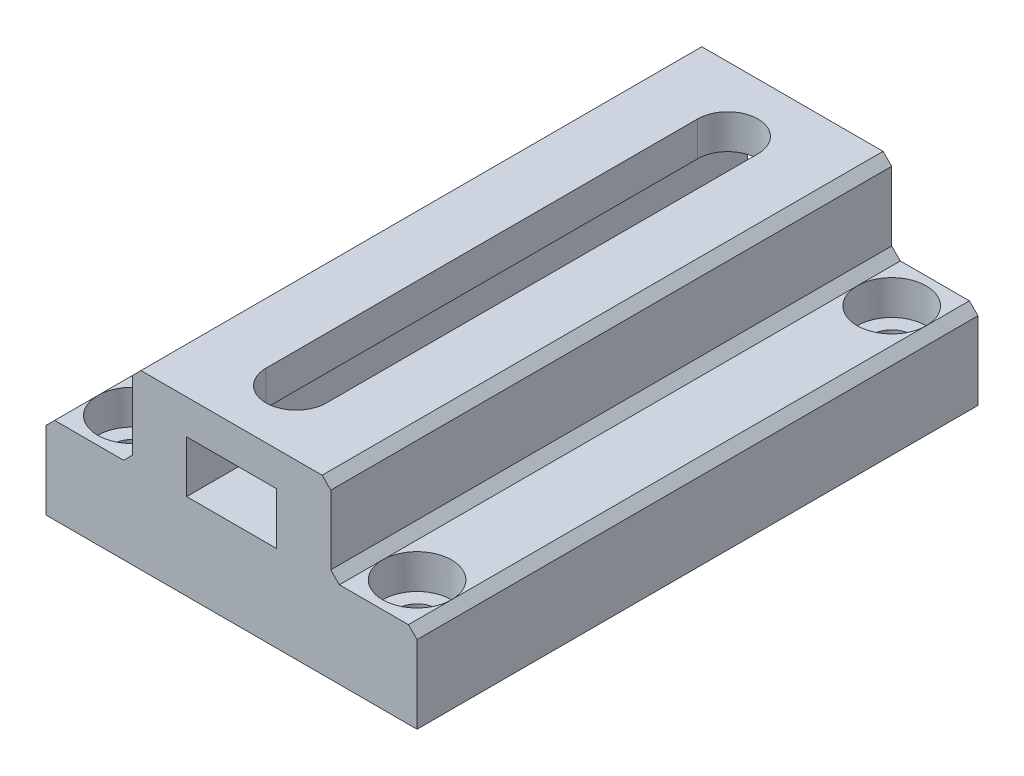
ISO-10303-21;
HEADER;
FILE_DESCRIPTION(('STEP AP214'),'2;1');
FILE_NAME('part.step','',(''),(''),'','','');
FILE_SCHEMA(('AUTOMOTIVE_DESIGN { 1 0 10303 214 1 1 1 1 }'));
ENDSEC;
DATA;
#1=APPLICATION_CONTEXT('core data for automotive mechanical design processes');
#2=APPLICATION_PROTOCOL_DEFINITION('international standard','automotive_design',2000,#1);
#3=PRODUCT_CONTEXT('',#1,'mechanical');
#4=PRODUCT('Part','Part','',(#3));
#5=PRODUCT_RELATED_PRODUCT_CATEGORY('part','',(#4));
#6=PRODUCT_DEFINITION_FORMATION('','',#4);
#7=PRODUCT_DEFINITION_CONTEXT('part definition',#1,'design');
#8=PRODUCT_DEFINITION('design','',#6,#7);
#9=PRODUCT_DEFINITION_SHAPE('','',#8);
#10=(LENGTH_UNIT() NAMED_UNIT(*) SI_UNIT(.MILLI.,.METRE.));
#11=(NAMED_UNIT(*) PLANE_ANGLE_UNIT() SI_UNIT($,.RADIAN.));
#12=(NAMED_UNIT(*) SI_UNIT($,.STERADIAN.) SOLID_ANGLE_UNIT());
#13=UNCERTAINTY_MEASURE_WITH_UNIT(LENGTH_MEASURE(1.E-05),#10,'distance_accuracy_value','');
#14=(GEOMETRIC_REPRESENTATION_CONTEXT(3) GLOBAL_UNCERTAINTY_ASSIGNED_CONTEXT((#13)) GLOBAL_UNIT_ASSIGNED_CONTEXT((#10,
#11,#12)) REPRESENTATION_CONTEXT('',''));
#15=CARTESIAN_POINT('',(0.,0.,0.));
#16=DIRECTION('',(0.,0.,1.));
#17=DIRECTION('',(1.,0.,0.));
#18=AXIS2_PLACEMENT_3D('',#15,#16,#17);
#19=CARTESIAN_POINT('',(21.5,10.,-32.5));
#20=DIRECTION('',(0.,1.,0.));
#21=DIRECTION('',(-1.,0.,0.));
#22=AXIS2_PLACEMENT_3D('',#19,#20,#21);
#23=PLANE('',#22);
#24=DIRECTION('',(-1.,0.,0.));
#25=VECTOR('',#24,1.);
#26=CARTESIAN_POINT('',(21.5,10.,-32.5));
#27=LINE('',#26,#25);
#28=CARTESIAN_POINT('',(20.5,10.,-32.5));
#29=VERTEX_POINT('',#28);
#30=CARTESIAN_POINT('',(12.5,10.,-32.5));
#31=VERTEX_POINT('',#30);
#32=EDGE_CURVE('E362',#29,#31,#27,.T.);
#33=ORIENTED_EDGE('',*,*,#32,.T.);
#34=DIRECTION('',(0.,0.,1.));
#35=VECTOR('',#34,1.);
#36=CARTESIAN_POINT('',(12.5,10.,32.5));
#37=LINE('',#36,#35);
#38=CARTESIAN_POINT('',(12.5,10.,-27.5));
#39=VERTEX_POINT('',#38);
#40=EDGE_CURVE('E523',#31,#39,#37,.T.);
#41=ORIENTED_EDGE('',*,*,#40,.T.);
#42=CARTESIAN_POINT('',(16.5,10.,-27.5));
#43=DIRECTION('',(0.,1.,0.));
#44=DIRECTION('',(0.,0.,1.));
#45=AXIS2_PLACEMENT_3D('',#42,#43,#44);
#46=CIRCLE('',#45,4.);
#47=CARTESIAN_POINT('',(20.5,10.,-27.5));
#48=VERTEX_POINT('',#47);
#49=EDGE_CURVE('E260',#48,#39,#46,.T.);
#50=ORIENTED_EDGE('',*,*,#49,.F.);
#51=DIRECTION('',(0.,0.,-1.));
#52=VECTOR('',#51,1.);
#53=CARTESIAN_POINT('',(20.5,10.,-32.5));
#54=LINE('',#53,#52);
#55=EDGE_CURVE('E508',#48,#29,#54,.T.);
#56=ORIENTED_EDGE('',*,*,#55,.T.);
#57=EDGE_LOOP('',(#33,#41,#50,#56));
#58=FACE_BOUND('',#57,.T.);
#59=ADVANCED_FACE('F39',(#58),#23,.T.);
#60=EDGE_CURVE('E259',#39,#48,#46,.T.);
#61=ORIENTED_EDGE('',*,*,#60,.F.);
#62=DIRECTION('',(0.,0.,1.));
#63=VECTOR('',#62,1.);
#64=CARTESIAN_POINT('',(12.5,10.,32.5));
#65=LINE('',#64,#63);
#66=CARTESIAN_POINT('',(12.5,10.,27.5));
#67=VERTEX_POINT('',#66);
#68=EDGE_CURVE('E520',#39,#67,#65,.T.);
#69=ORIENTED_EDGE('',*,*,#68,.T.);
#70=CARTESIAN_POINT('',(16.5,10.,27.5));
#71=DIRECTION('',(0.,1.,0.));
#72=DIRECTION('',(0.,0.,1.));
#73=AXIS2_PLACEMENT_3D('',#70,#71,#72);
#74=CIRCLE('',#73,4.);
#75=CARTESIAN_POINT('',(20.5,10.,27.5));
#76=VERTEX_POINT('',#75);
#77=EDGE_CURVE('E294',#76,#67,#74,.T.);
#78=ORIENTED_EDGE('',*,*,#77,.F.);
#79=DIRECTION('',(0.,0.,-1.));
#80=VECTOR('',#79,1.);
#81=CARTESIAN_POINT('',(20.5,10.,-32.5));
#82=LINE('',#81,#80);
#83=EDGE_CURVE('E511',#76,#48,#82,.T.);
#84=ORIENTED_EDGE('',*,*,#83,.T.);
#85=EDGE_LOOP('',(#61,#69,#78,#84));
#86=FACE_BOUND('',#85,.T.);
#87=ADVANCED_FACE('F641',(#86),#23,.T.);
#88=CARTESIAN_POINT('',(-21.5,10.,-32.5));
#89=DIRECTION('',(0.,-1.,0.));
#90=DIRECTION('',(1.,0.,0.));
#91=AXIS2_PLACEMENT_3D('',#88,#89,#90);
#92=PLANE('',#91);
#93=DIRECTION('',(1.,0.,0.));
#94=VECTOR('',#93,1.);
#95=CARTESIAN_POINT('',(-21.5,10.,-32.5));
#96=LINE('',#95,#94);
#97=CARTESIAN_POINT('',(-20.5,10.,-32.5));
#98=VERTEX_POINT('',#97);
#99=CARTESIAN_POINT('',(-12.5,10.,-32.5));
#100=VERTEX_POINT('',#99);
#101=EDGE_CURVE('E374',#98,#100,#96,.T.);
#102=ORIENTED_EDGE('',*,*,#101,.F.);
#103=DIRECTION('',(0.,0.,1.));
#104=VECTOR('',#103,1.);
#105=CARTESIAN_POINT('',(-20.5,10.,-32.5));
#106=LINE('',#105,#104);
#107=CARTESIAN_POINT('',(-20.5,10.,-27.5));
#108=VERTEX_POINT('',#107);
#109=EDGE_CURVE('E456',#98,#108,#106,.T.);
#110=ORIENTED_EDGE('',*,*,#109,.T.);
#111=CARTESIAN_POINT('',(-16.5,10.,-27.5));
#112=DIRECTION('',(0.,1.,0.));
#113=DIRECTION('',(0.,0.,1.));
#114=AXIS2_PLACEMENT_3D('',#111,#112,#113);
#115=CIRCLE('',#114,4.);
#116=CARTESIAN_POINT('',(-12.5,10.,-27.5));
#117=VERTEX_POINT('',#116);
#118=EDGE_CURVE('E243',#117,#108,#115,.T.);
#119=ORIENTED_EDGE('',*,*,#118,.F.);
#120=DIRECTION('',(0.,0.,-1.));
#121=VECTOR('',#120,1.);
#122=CARTESIAN_POINT('',(-12.5,10.,-32.5));
#123=LINE('',#122,#121);
#124=EDGE_CURVE('E441',#117,#100,#123,.T.);
#125=ORIENTED_EDGE('',*,*,#124,.T.);
#126=EDGE_LOOP('',(#102,#110,#119,#125));
#127=FACE_BOUND('',#126,.T.);
#128=ADVANCED_FACE('F588',(#127),#92,.F.);
#129=EDGE_CURVE('E242',#108,#117,#115,.T.);
#130=ORIENTED_EDGE('',*,*,#129,.F.);
#131=DIRECTION('',(0.,0.,1.));
#132=VECTOR('',#131,1.);
#133=CARTESIAN_POINT('',(-20.5,10.,-32.5));
#134=LINE('',#133,#132);
#135=CARTESIAN_POINT('',(-20.5,10.,27.5));
#136=VERTEX_POINT('',#135);
#137=EDGE_CURVE('E453',#108,#136,#134,.T.);
#138=ORIENTED_EDGE('',*,*,#137,.T.);
#139=CARTESIAN_POINT('',(-16.5,10.,27.5));
#140=DIRECTION('',(0.,1.,0.));
#141=DIRECTION('',(0.,0.,1.));
#142=AXIS2_PLACEMENT_3D('',#139,#140,#141);
#143=CIRCLE('',#142,4.);
#144=CARTESIAN_POINT('',(-12.5,10.,27.5));
#145=VERTEX_POINT('',#144);
#146=EDGE_CURVE('E277',#145,#136,#143,.T.);
#147=ORIENTED_EDGE('',*,*,#146,.F.);
#148=DIRECTION('',(0.,0.,-1.));
#149=VECTOR('',#148,1.);
#150=CARTESIAN_POINT('',(-12.5,10.,-32.5));
#151=LINE('',#150,#149);
#152=EDGE_CURVE('E444',#145,#117,#151,.T.);
#153=ORIENTED_EDGE('',*,*,#152,.T.);
#154=EDGE_LOOP('',(#130,#138,#147,#153));
#155=FACE_BOUND('',#154,.T.);
#156=ADVANCED_FACE('F621',(#155),#92,.F.);
#157=CARTESIAN_POINT('',(21.5,20.,-32.5));
#158=DIRECTION('',(-1.,0.,0.));
#159=DIRECTION('',(0.,0.,1.));
#160=AXIS2_PLACEMENT_3D('',#157,#158,#159);
#161=PLANE('',#160);
#162=DIRECTION('',(0.,-1.,0.));
#163=VECTOR('',#162,1.);
#164=CARTESIAN_POINT('',(21.5,20.,-32.5));
#165=LINE('',#164,#163);
#166=CARTESIAN_POINT('',(21.5,9.00000000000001,-32.5));
#167=VERTEX_POINT('',#166);
#168=CARTESIAN_POINT('',(21.5,0.,-32.5));
#169=VERTEX_POINT('',#168);
#170=EDGE_CURVE('E422',#167,#169,#165,.T.);
#171=ORIENTED_EDGE('',*,*,#170,.F.);
#172=DIRECTION('',(0.,0.,1.));
#173=VECTOR('',#172,1.);
#174=CARTESIAN_POINT('',(21.5,9.00000000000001,32.5));
#175=LINE('',#174,#173);
#176=CARTESIAN_POINT('',(21.5,9.00000000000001,32.5));
#177=VERTEX_POINT('',#176);
#178=EDGE_CURVE('E527',#167,#177,#175,.T.);
#179=ORIENTED_EDGE('',*,*,#178,.T.);
#180=DIRECTION('',(0.,-1.,0.));
#181=VECTOR('',#180,1.);
#182=CARTESIAN_POINT('',(21.5,20.,32.5));
#183=LINE('',#182,#181);
#184=CARTESIAN_POINT('',(21.5,0.,32.5));
#185=VERTEX_POINT('',#184);
#186=EDGE_CURVE('E399',#177,#185,#183,.T.);
#187=ORIENTED_EDGE('',*,*,#186,.T.);
#188=DIRECTION('',(0.,0.,-1.));
#189=VECTOR('',#188,1.);
#190=CARTESIAN_POINT('',(21.5,0.,-32.5));
#191=LINE('',#190,#189);
#192=EDGE_CURVE('E383',#185,#169,#191,.T.);
#193=ORIENTED_EDGE('',*,*,#192,.T.);
#194=EDGE_LOOP('',(#171,#179,#187,#193));
#195=FACE_BOUND('',#194,.T.);
#196=ADVANCED_FACE('F566',(#195),#161,.F.);
#197=CARTESIAN_POINT('',(-21.5,20.,-32.5));
#198=DIRECTION('',(0.,0.,1.));
#199=DIRECTION('',(1.,0.,0.));
#200=AXIS2_PLACEMENT_3D('',#197,#198,#199);
#201=PLANE('',#200);
#202=DIRECTION('',(-1.,0.,0.));
#203=VECTOR('',#202,1.);
#204=CARTESIAN_POINT('',(-21.5,0.,-32.5));
#205=LINE('',#204,#203);
#206=CARTESIAN_POINT('',(-21.5,0.,-32.5));
#207=VERTEX_POINT('',#206);
#208=EDGE_CURVE('E403',#169,#207,#205,.T.);
#209=ORIENTED_EDGE('',*,*,#208,.T.);
#210=DIRECTION('',(0.,-1.,0.));
#211=VECTOR('',#210,1.);
#212=CARTESIAN_POINT('',(-21.5,20.,-32.5));
#213=LINE('',#212,#211);
#214=CARTESIAN_POINT('',(-21.5,9.,-32.5));
#215=VERTEX_POINT('',#214);
#216=EDGE_CURVE('E418',#215,#207,#213,.T.);
#217=ORIENTED_EDGE('',*,*,#216,.F.);
#218=DIRECTION('',(-0.707106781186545,-0.70710678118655,0.));
#219=VECTOR('',#218,1.);
#220=CARTESIAN_POINT('',(-20.5,10.,-32.5));
#221=LINE('',#220,#219);
#222=EDGE_CURVE('E484',#215,#98,#221,.F.);
#223=ORIENTED_EDGE('',*,*,#222,.T.);
#224=ORIENTED_EDGE('',*,*,#101,.T.);
#225=DIRECTION('',(-0.707106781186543,-0.707106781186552,0.));
#226=VECTOR('',#225,1.);
#227=CARTESIAN_POINT('',(-11.9999999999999,10.5000000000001,-32.5));
#228=LINE('',#227,#226);
#229=CARTESIAN_POINT('',(-11.5,11.,-32.5));
#230=VERTEX_POINT('',#229);
#231=EDGE_CURVE('E534',#100,#230,#228,.F.);
#232=ORIENTED_EDGE('',*,*,#231,.T.);
#233=DIRECTION('',(0.,1.,0.));
#234=VECTOR('',#233,1.);
#235=CARTESIAN_POINT('',(-11.5,20.,-32.5));
#236=LINE('',#235,#234);
#237=CARTESIAN_POINT('',(-11.5,19.,-32.5));
#238=VERTEX_POINT('',#237);
#239=EDGE_CURVE('E378',#230,#238,#236,.T.);
#240=ORIENTED_EDGE('',*,*,#239,.T.);
#241=DIRECTION('',(0.707106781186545,0.70710678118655,0.));
#242=VECTOR('',#241,1.);
#243=CARTESIAN_POINT('',(-10.5,20.,-32.5));
#244=LINE('',#243,#242);
#245=CARTESIAN_POINT('',(-10.5,20.,-32.5));
#246=VERTEX_POINT('',#245);
#247=EDGE_CURVE('E481',#238,#246,#244,.T.);
#248=ORIENTED_EDGE('',*,*,#247,.T.);
#249=DIRECTION('',(-1.,0.,0.));
#250=VECTOR('',#249,1.);
#251=CARTESIAN_POINT('',(-21.5,20.,-32.5));
#252=LINE('',#251,#250);
#253=CARTESIAN_POINT('',(10.5,20.,-32.5));
#254=VERTEX_POINT('',#253);
#255=EDGE_CURVE('E390',#254,#246,#252,.T.);
#256=ORIENTED_EDGE('',*,*,#255,.F.);
#257=DIRECTION('',(-0.707106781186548,0.707106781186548,0.));
#258=VECTOR('',#257,1.);
#259=CARTESIAN_POINT('',(11.5,19.,-32.5));
#260=LINE('',#259,#258);
#261=CARTESIAN_POINT('',(11.5,19.,-32.5));
#262=VERTEX_POINT('',#261);
#263=EDGE_CURVE('E478',#254,#262,#260,.F.);
#264=ORIENTED_EDGE('',*,*,#263,.T.);
#265=DIRECTION('',(0.,1.,0.));
#266=VECTOR('',#265,1.);
#267=CARTESIAN_POINT('',(11.5,20.,-32.5));
#268=LINE('',#267,#266);
#269=CARTESIAN_POINT('',(11.5,11.,-32.5));
#270=VERTEX_POINT('',#269);
#271=EDGE_CURVE('E358',#270,#262,#268,.T.);
#272=ORIENTED_EDGE('',*,*,#271,.F.);
#273=DIRECTION('',(-0.70710678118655,0.707106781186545,0.));
#274=VECTOR('',#273,1.);
#275=CARTESIAN_POINT('',(-9.5000000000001,32.,-32.5));
#276=LINE('',#275,#274);
#277=EDGE_CURVE('E11',#270,#31,#276,.F.);
#278=ORIENTED_EDGE('',*,*,#277,.T.);
#279=ORIENTED_EDGE('',*,*,#32,.F.);
#280=DIRECTION('',(0.707106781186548,-0.707106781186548,0.));
#281=VECTOR('',#280,1.);
#282=CARTESIAN_POINT('',(21.5,9.00000000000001,-32.5));
#283=LINE('',#282,#281);
#284=EDGE_CURVE('E475',#29,#167,#283,.T.);
#285=ORIENTED_EDGE('',*,*,#284,.T.);
#286=ORIENTED_EDGE('',*,*,#170,.T.);
#287=EDGE_LOOP('',(#209,#217,#223,#224,#232,#240,#248,#256,#264,#272,#278,#279,#285,#286));
#288=FACE_BOUND('',#287,.T.);
#289=DIRECTION('',(0.,-1.,0.));
#290=VECTOR('',#289,1.);
#291=CARTESIAN_POINT('',(-5.2,0.,-32.5));
#292=LINE('',#291,#290);
#293=CARTESIAN_POINT('',(-5.2,16.,-32.5));
#294=VERTEX_POINT('',#293);
#295=CARTESIAN_POINT('',(-5.2,10.,-32.5));
#296=VERTEX_POINT('',#295);
#297=EDGE_CURVE('E338',#294,#296,#292,.T.);
#298=ORIENTED_EDGE('',*,*,#297,.T.);
#299=DIRECTION('',(-1.,0.,0.));
#300=VECTOR('',#299,1.);
#301=CARTESIAN_POINT('',(-5.20607799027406,10.,-32.5));
#302=LINE('',#301,#300);
#303=CARTESIAN_POINT('',(5.2,10.,-32.5));
#304=VERTEX_POINT('',#303);
#305=EDGE_CURVE('E232',#304,#296,#302,.T.);
#306=ORIENTED_EDGE('',*,*,#305,.F.);
#307=DIRECTION('',(0.,1.,0.));
#308=VECTOR('',#307,1.);
#309=CARTESIAN_POINT('',(5.2,0.,-32.5));
#310=LINE('',#309,#308);
#311=CARTESIAN_POINT('',(5.2,16.,-32.5));
#312=VERTEX_POINT('',#311);
#313=EDGE_CURVE('E227',#304,#312,#310,.T.);
#314=ORIENTED_EDGE('',*,*,#313,.T.);
#315=DIRECTION('',(-1.,0.,0.));
#316=VECTOR('',#315,1.);
#317=CARTESIAN_POINT('',(-5.2,16.,-32.5));
#318=LINE('',#317,#316);
#319=EDGE_CURVE('E343',#312,#294,#318,.T.);
#320=ORIENTED_EDGE('',*,*,#319,.T.);
#321=EDGE_LOOP('',(#298,#306,#314,#320));
#322=FACE_BOUND('',#321,.T.);
#323=ADVANCED_FACE('F552',(#288,#322),#201,.F.);
#324=CARTESIAN_POINT('',(-21.5,20.,32.5));
#325=DIRECTION('',(0.,0.,-1.));
#326=DIRECTION('',(-1.,0.,0.));
#327=AXIS2_PLACEMENT_3D('',#324,#325,#326);
#328=PLANE('',#327);
#329=DIRECTION('',(-1.,0.,0.));
#330=VECTOR('',#329,1.);
#331=CARTESIAN_POINT('',(-5.20607799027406,10.,32.5));
#332=LINE('',#331,#330);
#333=CARTESIAN_POINT('',(5.2,10.,32.5));
#334=VERTEX_POINT('',#333);
#335=CARTESIAN_POINT('',(-5.2,10.,32.5));
#336=VERTEX_POINT('',#335);
#337=EDGE_CURVE('E216',#334,#336,#332,.T.);
#338=ORIENTED_EDGE('',*,*,#337,.T.);
#339=DIRECTION('',(0.,-1.,0.));
#340=VECTOR('',#339,1.);
#341=CARTESIAN_POINT('',(-5.2,0.,32.5));
#342=LINE('',#341,#340);
#343=CARTESIAN_POINT('',(-5.2,16.,32.5));
#344=VERTEX_POINT('',#343);
#345=EDGE_CURVE('E60',#344,#336,#342,.T.);
#346=ORIENTED_EDGE('',*,*,#345,.F.);
#347=DIRECTION('',(-1.,0.,0.));
#348=VECTOR('',#347,1.);
#349=CARTESIAN_POINT('',(-5.2,16.,32.5));
#350=LINE('',#349,#348);
#351=CARTESIAN_POINT('',(5.2,16.,32.5));
#352=VERTEX_POINT('',#351);
#353=EDGE_CURVE('E218',#352,#344,#350,.T.);
#354=ORIENTED_EDGE('',*,*,#353,.F.);
#355=DIRECTION('',(0.,1.,0.));
#356=VECTOR('',#355,1.);
#357=CARTESIAN_POINT('',(5.2,0.,32.5));
#358=LINE('',#357,#356);
#359=EDGE_CURVE('E211',#334,#352,#358,.T.);
#360=ORIENTED_EDGE('',*,*,#359,.F.);
#361=EDGE_LOOP('',(#338,#346,#354,#360));
#362=FACE_BOUND('',#361,.T.);
#363=DIRECTION('',(1.,0.,0.));
#364=VECTOR('',#363,1.);
#365=CARTESIAN_POINT('',(-21.5,0.,32.5));
#366=LINE('',#365,#364);
#367=CARTESIAN_POINT('',(-21.5,0.,32.5));
#368=VERTEX_POINT('',#367);
#369=EDGE_CURVE('E395',#368,#185,#366,.T.);
#370=ORIENTED_EDGE('',*,*,#369,.T.);
#371=ORIENTED_EDGE('',*,*,#186,.F.);
#372=DIRECTION('',(-0.707106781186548,0.707106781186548,0.));
#373=VECTOR('',#372,1.);
#374=CARTESIAN_POINT('',(21.5,9.00000000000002,32.5));
#375=LINE('',#374,#373);
#376=CARTESIAN_POINT('',(20.5,10.,32.5));
#377=VERTEX_POINT('',#376);
#378=EDGE_CURVE('E460',#177,#377,#375,.T.);
#379=ORIENTED_EDGE('',*,*,#378,.T.);
#380=DIRECTION('',(-1.,0.,0.));
#381=VECTOR('',#380,1.);
#382=CARTESIAN_POINT('',(21.5,10.,32.5));
#383=LINE('',#382,#381);
#384=CARTESIAN_POINT('',(12.5,10.,32.5));
#385=VERTEX_POINT('',#384);
#386=EDGE_CURVE('E363',#377,#385,#383,.T.);
#387=ORIENTED_EDGE('',*,*,#386,.T.);
#388=DIRECTION('',(0.70710678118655,-0.707106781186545,0.));
#389=VECTOR('',#388,1.);
#390=CARTESIAN_POINT('',(-9.5000000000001,32.,32.5));
#391=LINE('',#390,#389);
#392=CARTESIAN_POINT('',(11.5,11.,32.5));
#393=VERTEX_POINT('',#392);
#394=EDGE_CURVE('E48',#385,#393,#391,.F.);
#395=ORIENTED_EDGE('',*,*,#394,.T.);
#396=DIRECTION('',(0.,1.,0.));
#397=VECTOR('',#396,1.);
#398=CARTESIAN_POINT('',(11.5,20.,32.5));
#399=LINE('',#398,#397);
#400=CARTESIAN_POINT('',(11.5,19.,32.5));
#401=VERTEX_POINT('',#400);
#402=EDGE_CURVE('E355',#393,#401,#399,.T.);
#403=ORIENTED_EDGE('',*,*,#402,.T.);
#404=DIRECTION('',(0.707106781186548,-0.707106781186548,0.));
#405=VECTOR('',#404,1.);
#406=CARTESIAN_POINT('',(11.5,19.,32.5));
#407=LINE('',#406,#405);
#408=CARTESIAN_POINT('',(10.5,20.,32.5));
#409=VERTEX_POINT('',#408);
#410=EDGE_CURVE('E463',#401,#409,#407,.F.);
#411=ORIENTED_EDGE('',*,*,#410,.T.);
#412=DIRECTION('',(1.,0.,0.));
#413=VECTOR('',#412,1.);
#414=CARTESIAN_POINT('',(-21.5,20.,32.5));
#415=LINE('',#414,#413);
#416=CARTESIAN_POINT('',(-10.5,20.,32.5));
#417=VERTEX_POINT('',#416);
#418=EDGE_CURVE('E394',#417,#409,#415,.T.);
#419=ORIENTED_EDGE('',*,*,#418,.F.);
#420=DIRECTION('',(-0.707106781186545,-0.70710678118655,0.));
#421=VECTOR('',#420,1.);
#422=CARTESIAN_POINT('',(-10.5,20.,32.5));
#423=LINE('',#422,#421);
#424=CARTESIAN_POINT('',(-11.5,19.,32.5));
#425=VERTEX_POINT('',#424);
#426=EDGE_CURVE('E466',#417,#425,#423,.T.);
#427=ORIENTED_EDGE('',*,*,#426,.T.);
#428=DIRECTION('',(0.,1.,0.));
#429=VECTOR('',#428,1.);
#430=CARTESIAN_POINT('',(-11.5,20.,32.5));
#431=LINE('',#430,#429);
#432=CARTESIAN_POINT('',(-11.5,11.,32.5));
#433=VERTEX_POINT('',#432);
#434=EDGE_CURVE('E379',#433,#425,#431,.T.);
#435=ORIENTED_EDGE('',*,*,#434,.F.);
#436=DIRECTION('',(0.707106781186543,0.707106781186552,0.));
#437=VECTOR('',#436,1.);
#438=CARTESIAN_POINT('',(-11.9999999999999,10.5000000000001,32.5));
#439=LINE('',#438,#437);
#440=CARTESIAN_POINT('',(-12.5,10.,32.5));
#441=VERTEX_POINT('',#440);
#442=EDGE_CURVE('E531',#433,#441,#439,.F.);
#443=ORIENTED_EDGE('',*,*,#442,.T.);
#444=DIRECTION('',(1.,0.,0.));
#445=VECTOR('',#444,1.);
#446=CARTESIAN_POINT('',(-21.5,10.,32.5));
#447=LINE('',#446,#445);
#448=CARTESIAN_POINT('',(-20.5,10.,32.5));
#449=VERTEX_POINT('',#448);
#450=EDGE_CURVE('E367',#449,#441,#447,.T.);
#451=ORIENTED_EDGE('',*,*,#450,.F.);
#452=DIRECTION('',(0.707106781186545,0.70710678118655,0.));
#453=VECTOR('',#452,1.);
#454=CARTESIAN_POINT('',(-20.5,10.,32.5));
#455=LINE('',#454,#453);
#456=CARTESIAN_POINT('',(-21.5,9.,32.5));
#457=VERTEX_POINT('',#456);
#458=EDGE_CURVE('E469',#449,#457,#455,.F.);
#459=ORIENTED_EDGE('',*,*,#458,.T.);
#460=DIRECTION('',(0.,-1.,0.));
#461=VECTOR('',#460,1.);
#462=CARTESIAN_POINT('',(-21.5,20.,32.5));
#463=LINE('',#462,#461);
#464=EDGE_CURVE('E415',#457,#368,#463,.T.);
#465=ORIENTED_EDGE('',*,*,#464,.T.);
#466=EDGE_LOOP('',(#370,#371,#379,#387,#395,#403,#411,#419,#427,#435,#443,#451,#459,#465));
#467=FACE_BOUND('',#466,.T.);
#468=ADVANCED_FACE('F213',(#362,#467),#328,.F.);
#469=CARTESIAN_POINT('',(0.,20.,0.));
#470=DIRECTION('',(0.,1.,0.));
#471=DIRECTION('',(0.,0.,1.));
#472=AXIS2_PLACEMENT_3D('',#469,#470,#471);
#473=PLANE('',#472);
#474=CARTESIAN_POINT('',(0.,20.,25.));
#475=DIRECTION('',(0.,1.,0.));
#476=DIRECTION('',(0.,0.,1.));
#477=AXIS2_PLACEMENT_3D('',#474,#475,#476);
#478=CIRCLE('',#477,3.5);
#479=CARTESIAN_POINT('',(-3.5,20.,25.));
#480=VERTEX_POINT('',#479);
#481=CARTESIAN_POINT('',(3.5,20.,25.));
#482=VERTEX_POINT('',#481);
#483=EDGE_CURVE('E310',#480,#482,#478,.T.);
#484=ORIENTED_EDGE('',*,*,#483,.F.);
#485=DIRECTION('',(0.,0.,1.));
#486=VECTOR('',#485,1.);
#487=CARTESIAN_POINT('',(-3.5,20.,25.));
#488=LINE('',#487,#486);
#489=CARTESIAN_POINT('',(-3.5,20.,-25.));
#490=VERTEX_POINT('',#489);
#491=EDGE_CURVE('E321',#490,#480,#488,.T.);
#492=ORIENTED_EDGE('',*,*,#491,.F.);
#493=CARTESIAN_POINT('',(0.,20.,-25.));
#494=DIRECTION('',(0.,1.,0.));
#495=DIRECTION('',(0.,0.,1.));
#496=AXIS2_PLACEMENT_3D('',#493,#494,#495);
#497=CIRCLE('',#496,3.5);
#498=CARTESIAN_POINT('',(3.5,20.,-25.));
#499=VERTEX_POINT('',#498);
#500=EDGE_CURVE('E317',#499,#490,#497,.T.);
#501=ORIENTED_EDGE('',*,*,#500,.F.);
#502=DIRECTION('',(0.,0.,-1.));
#503=VECTOR('',#502,1.);
#504=CARTESIAN_POINT('',(3.5,20.,25.));
#505=LINE('',#504,#503);
#506=EDGE_CURVE('E313',#482,#499,#505,.T.);
#507=ORIENTED_EDGE('',*,*,#506,.F.);
#508=EDGE_LOOP('',(#484,#492,#501,#507));
#509=FACE_BOUND('',#508,.T.);
#510=ORIENTED_EDGE('',*,*,#255,.T.);
#511=DIRECTION('',(0.,0.,1.));
#512=VECTOR('',#511,1.);
#513=CARTESIAN_POINT('',(-10.5,20.,32.5));
#514=LINE('',#513,#512);
#515=EDGE_CURVE('E497',#246,#417,#514,.T.);
#516=ORIENTED_EDGE('',*,*,#515,.T.);
#517=ORIENTED_EDGE('',*,*,#418,.T.);
#518=DIRECTION('',(0.,0.,-1.));
#519=VECTOR('',#518,1.);
#520=CARTESIAN_POINT('',(10.5,20.,0.));
#521=LINE('',#520,#519);
#522=EDGE_CURVE('E494',#409,#254,#521,.T.);
#523=ORIENTED_EDGE('',*,*,#522,.T.);
#524=EDGE_LOOP('',(#510,#516,#517,#523));
#525=FACE_BOUND('',#524,.T.);
#526=ADVANCED_FACE('F609',(#509,#525),#473,.T.);
#527=CARTESIAN_POINT('',(-21.5,20.,-32.5));
#528=DIRECTION('',(1.,0.,0.));
#529=DIRECTION('',(0.,0.,-1.));
#530=AXIS2_PLACEMENT_3D('',#527,#528,#529);
#531=PLANE('',#530);
#532=ORIENTED_EDGE('',*,*,#464,.F.);
#533=DIRECTION('',(0.,0.,-1.));
#534=VECTOR('',#533,1.);
#535=CARTESIAN_POINT('',(-21.5,9.,-32.5));
#536=LINE('',#535,#534);
#537=EDGE_CURVE('E472',#457,#215,#536,.T.);
#538=ORIENTED_EDGE('',*,*,#537,.T.);
#539=ORIENTED_EDGE('',*,*,#216,.T.);
#540=DIRECTION('',(0.,0.,1.));
#541=VECTOR('',#540,1.);
#542=CARTESIAN_POINT('',(-21.5,0.,-32.5));
#543=LINE('',#542,#541);
#544=EDGE_CURVE('E406',#207,#368,#543,.T.);
#545=ORIENTED_EDGE('',*,*,#544,.T.);
#546=EDGE_LOOP('',(#532,#538,#539,#545));
#547=FACE_BOUND('',#546,.T.);
#548=ADVANCED_FACE('F578',(#547),#531,.F.);
#549=CARTESIAN_POINT('',(0.,0.,0.));
#550=DIRECTION('',(0.,1.,0.));
#551=DIRECTION('',(0.,0.,1.));
#552=AXIS2_PLACEMENT_3D('',#549,#550,#551);
#553=PLANE('',#552);
#554=CARTESIAN_POINT('',(16.5,0.,-27.5));
#555=DIRECTION('',(0.,1.,0.));
#556=DIRECTION('',(0.,0.,1.));
#557=AXIS2_PLACEMENT_3D('',#554,#555,#556);
#558=CIRCLE('',#557,2.25);
#559=CARTESIAN_POINT('',(16.5,0.,-25.25));
#560=VERTEX_POINT('',#559);
#561=EDGE_CURVE('E272',#560,#560,#558,.T.);
#562=ORIENTED_EDGE('',*,*,#561,.T.);
#563=EDGE_LOOP('',(#562));
#564=FACE_BOUND('',#563,.T.);
#565=CARTESIAN_POINT('',(16.5,0.,27.5));
#566=DIRECTION('',(0.,1.,0.));
#567=DIRECTION('',(0.,0.,1.));
#568=AXIS2_PLACEMENT_3D('',#565,#566,#567);
#569=CIRCLE('',#568,2.25);
#570=CARTESIAN_POINT('',(16.5,0.,29.75));
#571=VERTEX_POINT('',#570);
#572=EDGE_CURVE('E306',#571,#571,#569,.T.);
#573=ORIENTED_EDGE('',*,*,#572,.T.);
#574=EDGE_LOOP('',(#573));
#575=FACE_BOUND('',#574,.T.);
#576=ORIENTED_EDGE('',*,*,#192,.F.);
#577=ORIENTED_EDGE('',*,*,#369,.F.);
#578=ORIENTED_EDGE('',*,*,#544,.F.);
#579=ORIENTED_EDGE('',*,*,#208,.F.);
#580=EDGE_LOOP('',(#576,#577,#578,#579));
#581=FACE_BOUND('',#580,.T.);
#582=CARTESIAN_POINT('',(-16.5,0.,-27.5));
#583=DIRECTION('',(0.,1.,0.));
#584=DIRECTION('',(0.,0.,1.));
#585=AXIS2_PLACEMENT_3D('',#582,#583,#584);
#586=CIRCLE('',#585,2.25);
#587=CARTESIAN_POINT('',(-16.5,0.,-25.25));
#588=VERTEX_POINT('',#587);
#589=EDGE_CURVE('E255',#588,#588,#586,.T.);
#590=ORIENTED_EDGE('',*,*,#589,.T.);
#591=EDGE_LOOP('',(#590));
#592=FACE_BOUND('',#591,.T.);
#593=CARTESIAN_POINT('',(-16.5,0.,27.5));
#594=DIRECTION('',(0.,1.,0.));
#595=DIRECTION('',(0.,0.,1.));
#596=AXIS2_PLACEMENT_3D('',#593,#594,#595);
#597=CIRCLE('',#596,2.25);
#598=CARTESIAN_POINT('',(-16.5,0.,29.75));
#599=VERTEX_POINT('',#598);
#600=EDGE_CURVE('E289',#599,#599,#597,.T.);
#601=ORIENTED_EDGE('',*,*,#600,.T.);
#602=EDGE_LOOP('',(#601));
#603=FACE_BOUND('',#602,.T.);
#604=ADVANCED_FACE('F571',(#564,#575,#581,#592,#603),#553,.F.);
#605=CARTESIAN_POINT('',(-11.5,20.,-32.5));
#606=DIRECTION('',(1.,0.,0.));
#607=DIRECTION('',(0.,1.,0.));
#608=AXIS2_PLACEMENT_3D('',#605,#606,#607);
#609=PLANE('',#608);
#610=ORIENTED_EDGE('',*,*,#239,.F.);
#611=DIRECTION('',(0.,0.,1.));
#612=VECTOR('',#611,1.);
#613=CARTESIAN_POINT('',(-11.5,11.,32.5));
#614=LINE('',#613,#612);
#615=EDGE_CURVE('E490',#230,#433,#614,.T.);
#616=ORIENTED_EDGE('',*,*,#615,.T.);
#617=ORIENTED_EDGE('',*,*,#434,.T.);
#618=DIRECTION('',(0.,0.,-1.));
#619=VECTOR('',#618,1.);
#620=CARTESIAN_POINT('',(-11.5,19.,-32.5));
#621=LINE('',#620,#619);
#622=EDGE_CURVE('E487',#425,#238,#621,.T.);
#623=ORIENTED_EDGE('',*,*,#622,.T.);
#624=EDGE_LOOP('',(#610,#616,#617,#623));
#625=FACE_BOUND('',#624,.T.);
#626=ADVANCED_FACE('F600',(#625),#609,.F.);
#627=EDGE_CURVE('E276',#136,#145,#143,.T.);
#628=ORIENTED_EDGE('',*,*,#627,.F.);
#629=DIRECTION('',(0.,0.,1.));
#630=VECTOR('',#629,1.);
#631=CARTESIAN_POINT('',(-20.5,10.,-32.5));
#632=LINE('',#631,#630);
#633=EDGE_CURVE('E450',#136,#449,#632,.T.);
#634=ORIENTED_EDGE('',*,*,#633,.T.);
#635=ORIENTED_EDGE('',*,*,#450,.T.);
#636=DIRECTION('',(0.,0.,-1.));
#637=VECTOR('',#636,1.);
#638=CARTESIAN_POINT('',(-12.5,10.,-32.5));
#639=LINE('',#638,#637);
#640=EDGE_CURVE('E447',#441,#145,#639,.T.);
#641=ORIENTED_EDGE('',*,*,#640,.T.);
#642=EDGE_LOOP('',(#628,#634,#635,#641));
#643=FACE_BOUND('',#642,.T.);
#644=ADVANCED_FACE('F617',(#643),#92,.F.);
#645=EDGE_CURVE('E293',#67,#76,#74,.T.);
#646=ORIENTED_EDGE('',*,*,#645,.F.);
#647=DIRECTION('',(0.,0.,1.));
#648=VECTOR('',#647,1.);
#649=CARTESIAN_POINT('',(12.5,10.,32.5));
#650=LINE('',#649,#648);
#651=EDGE_CURVE('E517',#67,#385,#650,.T.);
#652=ORIENTED_EDGE('',*,*,#651,.T.);
#653=ORIENTED_EDGE('',*,*,#386,.F.);
#654=DIRECTION('',(0.,0.,-1.));
#655=VECTOR('',#654,1.);
#656=CARTESIAN_POINT('',(20.5,10.,-32.5));
#657=LINE('',#656,#655);
#658=EDGE_CURVE('E514',#377,#76,#657,.T.);
#659=ORIENTED_EDGE('',*,*,#658,.T.);
#660=EDGE_LOOP('',(#646,#652,#653,#659));
#661=FACE_BOUND('',#660,.T.);
#662=ADVANCED_FACE('F643',(#661),#23,.T.);
#663=CARTESIAN_POINT('',(11.5,20.,-32.5));
#664=DIRECTION('',(1.,0.,0.));
#665=DIRECTION('',(0.,1.,0.));
#666=AXIS2_PLACEMENT_3D('',#663,#664,#665);
#667=PLANE('',#666);
#668=ORIENTED_EDGE('',*,*,#271,.T.);
#669=DIRECTION('',(0.,0.,1.));
#670=VECTOR('',#669,1.);
#671=CARTESIAN_POINT('',(11.5,19.,-32.5));
#672=LINE('',#671,#670);
#673=EDGE_CURVE('E504',#262,#401,#672,.T.);
#674=ORIENTED_EDGE('',*,*,#673,.T.);
#675=ORIENTED_EDGE('',*,*,#402,.F.);
#676=DIRECTION('',(0.,0.,-1.));
#677=VECTOR('',#676,1.);
#678=CARTESIAN_POINT('',(11.5,11.,-32.5));
#679=LINE('',#678,#677);
#680=EDGE_CURVE('E501',#393,#270,#679,.T.);
#681=ORIENTED_EDGE('',*,*,#680,.T.);
#682=EDGE_LOOP('',(#668,#674,#675,#681));
#683=FACE_BOUND('',#682,.T.);
#684=ADVANCED_FACE('F544',(#683),#667,.T.);
#685=CARTESIAN_POINT('',(-5.2,0.,-32.5));
#686=DIRECTION('',(-1.,0.,0.));
#687=DIRECTION('',(0.,-1.,0.));
#688=AXIS2_PLACEMENT_3D('',#685,#686,#687);
#689=PLANE('',#688);
#690=ORIENTED_EDGE('',*,*,#345,.T.);
#691=DIRECTION('',(0.,0.,-1.));
#692=VECTOR('',#691,1.);
#693=CARTESIAN_POINT('',(-5.2,10.,-32.5));
#694=LINE('',#693,#692);
#695=EDGE_CURVE('E55',#336,#296,#694,.T.);
#696=ORIENTED_EDGE('',*,*,#695,.T.);
#697=ORIENTED_EDGE('',*,*,#297,.F.);
#698=DIRECTION('',(0.,0.,1.));
#699=VECTOR('',#698,1.);
#700=CARTESIAN_POINT('',(-5.2,16.,-32.5));
#701=LINE('',#700,#699);
#702=EDGE_CURVE('E352',#294,#344,#701,.T.);
#703=ORIENTED_EDGE('',*,*,#702,.T.);
#704=EDGE_LOOP('',(#690,#696,#697,#703));
#705=FACE_BOUND('',#704,.T.);
#706=ADVANCED_FACE('F656',(#705),#689,.F.);
#707=CARTESIAN_POINT('',(-5.2,16.,-32.5));
#708=DIRECTION('',(0.,1.,0.));
#709=DIRECTION('',(0.,0.,1.));
#710=AXIS2_PLACEMENT_3D('',#707,#708,#709);
#711=PLANE('',#710);
#712=DIRECTION('',(0.,0.,1.));
#713=VECTOR('',#712,1.);
#714=CARTESIAN_POINT('',(-3.5,16.,-32.5));
#715=LINE('',#714,#713);
#716=CARTESIAN_POINT('',(-3.5,16.,-25.));
#717=VERTEX_POINT('',#716);
#718=CARTESIAN_POINT('',(-3.5,16.,25.));
#719=VERTEX_POINT('',#718);
#720=EDGE_CURVE('E433',#717,#719,#715,.T.);
#721=ORIENTED_EDGE('',*,*,#720,.T.);
#722=CARTESIAN_POINT('',(0.,16.,25.));
#723=DIRECTION('',(0.,1.,0.));
#724=DIRECTION('',(0.,0.,1.));
#725=AXIS2_PLACEMENT_3D('',#722,#723,#724);
#726=CIRCLE('',#725,3.5);
#727=CARTESIAN_POINT('',(3.5,16.,25.));
#728=VERTEX_POINT('',#727);
#729=EDGE_CURVE('E437',#719,#728,#726,.T.);
#730=ORIENTED_EDGE('',*,*,#729,.T.);
#731=DIRECTION('',(0.,0.,-1.));
#732=VECTOR('',#731,1.);
#733=CARTESIAN_POINT('',(3.5,16.,-32.5));
#734=LINE('',#733,#732);
#735=CARTESIAN_POINT('',(3.5,16.,-25.));
#736=VERTEX_POINT('',#735);
#737=EDGE_CURVE('E425',#728,#736,#734,.T.);
#738=ORIENTED_EDGE('',*,*,#737,.T.);
#739=CARTESIAN_POINT('',(0.,16.,-25.));
#740=DIRECTION('',(0.,1.,0.));
#741=DIRECTION('',(0.,0.,1.));
#742=AXIS2_PLACEMENT_3D('',#739,#740,#741);
#743=CIRCLE('',#742,3.5);
#744=EDGE_CURVE('E429',#736,#717,#743,.T.);
#745=ORIENTED_EDGE('',*,*,#744,.T.);
#746=EDGE_LOOP('',(#721,#730,#738,#745));
#747=FACE_BOUND('',#746,.T.);
#748=ORIENTED_EDGE('',*,*,#353,.T.);
#749=ORIENTED_EDGE('',*,*,#702,.F.);
#750=ORIENTED_EDGE('',*,*,#319,.F.);
#751=DIRECTION('',(0.,0.,1.));
#752=VECTOR('',#751,1.);
#753=CARTESIAN_POINT('',(5.2,16.,-32.5));
#754=LINE('',#753,#752);
#755=EDGE_CURVE('E347',#312,#352,#754,.T.);
#756=ORIENTED_EDGE('',*,*,#755,.T.);
#757=EDGE_LOOP('',(#748,#749,#750,#756));
#758=FACE_BOUND('',#757,.T.);
#759=ADVANCED_FACE('F725',(#747,#758),#711,.F.);
#760=CARTESIAN_POINT('',(5.2,0.,-32.5));
#761=DIRECTION('',(1.,0.,0.));
#762=DIRECTION('',(0.,0.,-1.));
#763=AXIS2_PLACEMENT_3D('',#760,#761,#762);
#764=PLANE('',#763);
#765=ORIENTED_EDGE('',*,*,#313,.F.);
#766=DIRECTION('',(0.,0.,1.));
#767=VECTOR('',#766,1.);
#768=CARTESIAN_POINT('',(5.2,10.,-32.5));
#769=LINE('',#768,#767);
#770=EDGE_CURVE('E225',#304,#334,#769,.T.);
#771=ORIENTED_EDGE('',*,*,#770,.T.);
#772=ORIENTED_EDGE('',*,*,#359,.T.);
#773=ORIENTED_EDGE('',*,*,#755,.F.);
#774=EDGE_LOOP('',(#765,#771,#772,#773));
#775=FACE_BOUND('',#774,.T.);
#776=ADVANCED_FACE('F226',(#775),#764,.F.);
#777=CARTESIAN_POINT('',(0.,0.,25.));
#778=DIRECTION('',(0.,1.,0.));
#779=DIRECTION('',(0.,0.,1.));
#780=AXIS2_PLACEMENT_3D('',#777,#778,#779);
#781=CYLINDRICAL_SURFACE('',#780,3.5);
#782=DIRECTION('',(0.,1.,0.));
#783=VECTOR('',#782,1.);
#784=CARTESIAN_POINT('',(-3.5,0.,25.));
#785=LINE('',#784,#783);
#786=EDGE_CURVE('E326',#719,#480,#785,.T.);
#787=ORIENTED_EDGE('',*,*,#786,.T.);
#788=ORIENTED_EDGE('',*,*,#483,.T.);
#789=DIRECTION('',(0.,1.,0.));
#790=VECTOR('',#789,1.);
#791=CARTESIAN_POINT('',(3.5,0.,25.));
#792=LINE('',#791,#790);
#793=EDGE_CURVE('E325',#728,#482,#792,.T.);
#794=ORIENTED_EDGE('',*,*,#793,.F.);
#795=ORIENTED_EDGE('',*,*,#729,.F.);
#796=EDGE_LOOP('',(#787,#788,#794,#795));
#797=FACE_BOUND('',#796,.T.);
#798=ADVANCED_FACE('F714',(#797),#781,.F.);
#799=CARTESIAN_POINT('',(-3.5,0.,25.));
#800=DIRECTION('',(-1.,0.,0.));
#801=DIRECTION('',(0.,0.,1.));
#802=AXIS2_PLACEMENT_3D('',#799,#800,#801);
#803=PLANE('',#802);
#804=DIRECTION('',(0.,1.,0.));
#805=VECTOR('',#804,1.);
#806=CARTESIAN_POINT('',(-3.5,0.,-25.));
#807=LINE('',#806,#805);
#808=EDGE_CURVE('E329',#717,#490,#807,.T.);
#809=ORIENTED_EDGE('',*,*,#808,.T.);
#810=ORIENTED_EDGE('',*,*,#491,.T.);
#811=ORIENTED_EDGE('',*,*,#786,.F.);
#812=ORIENTED_EDGE('',*,*,#720,.F.);
#813=EDGE_LOOP('',(#809,#810,#811,#812));
#814=FACE_BOUND('',#813,.T.);
#815=ADVANCED_FACE('F710',(#814),#803,.F.);
#816=CARTESIAN_POINT('',(0.,0.,-25.));
#817=DIRECTION('',(0.,1.,0.));
#818=DIRECTION('',(0.,0.,1.));
#819=AXIS2_PLACEMENT_3D('',#816,#817,#818);
#820=CYLINDRICAL_SURFACE('',#819,3.5);
#821=DIRECTION('',(0.,1.,0.));
#822=VECTOR('',#821,1.);
#823=CARTESIAN_POINT('',(3.5,0.,-25.));
#824=LINE('',#823,#822);
#825=EDGE_CURVE('E332',#736,#499,#824,.T.);
#826=ORIENTED_EDGE('',*,*,#825,.T.);
#827=ORIENTED_EDGE('',*,*,#500,.T.);
#828=ORIENTED_EDGE('',*,*,#808,.F.);
#829=ORIENTED_EDGE('',*,*,#744,.F.);
#830=EDGE_LOOP('',(#826,#827,#828,#829));
#831=FACE_BOUND('',#830,.T.);
#832=ADVANCED_FACE('F713',(#831),#820,.F.);
#833=CARTESIAN_POINT('',(3.5,0.,25.));
#834=DIRECTION('',(1.,0.,0.));
#835=DIRECTION('',(0.,0.,-1.));
#836=AXIS2_PLACEMENT_3D('',#833,#834,#835);
#837=PLANE('',#836);
#838=ORIENTED_EDGE('',*,*,#793,.T.);
#839=ORIENTED_EDGE('',*,*,#506,.T.);
#840=ORIENTED_EDGE('',*,*,#825,.F.);
#841=ORIENTED_EDGE('',*,*,#737,.F.);
#842=EDGE_LOOP('',(#838,#839,#840,#841));
#843=FACE_BOUND('',#842,.T.);
#844=ADVANCED_FACE('F708',(#843),#837,.F.);
#845=CARTESIAN_POINT('',(16.5,10.,27.5));
#846=DIRECTION('',(0.,1.,0.));
#847=DIRECTION('',(0.,0.,1.));
#848=AXIS2_PLACEMENT_3D('',#845,#846,#847);
#849=CYLINDRICAL_SURFACE('',#848,2.25);
#850=ORIENTED_EDGE('',*,*,#572,.F.);
#851=EDGE_LOOP('',(#850));
#852=FACE_BOUND('',#851,.T.);
#853=CARTESIAN_POINT('',(16.5,6.,27.5));
#854=DIRECTION('',(0.,1.,0.));
#855=DIRECTION('',(0.,0.,1.));
#856=AXIS2_PLACEMENT_3D('',#853,#854,#855);
#857=CIRCLE('',#856,2.25);
#858=CARTESIAN_POINT('',(16.5,6.,29.75));
#859=VERTEX_POINT('',#858);
#860=EDGE_CURVE('E302',#859,#859,#857,.T.);
#861=ORIENTED_EDGE('',*,*,#860,.T.);
#862=EDGE_LOOP('',(#861));
#863=FACE_BOUND('',#862,.T.);
#864=ADVANCED_FACE('F704',(#852,#863),#849,.F.);
#865=CARTESIAN_POINT('',(18.75,6.,27.5));
#866=DIRECTION('',(0.,-1.,0.));
#867=DIRECTION('',(0.,0.,-1.));
#868=AXIS2_PLACEMENT_3D('',#865,#866,#867);
#869=PLANE('',#868);
#870=ORIENTED_EDGE('',*,*,#860,.F.);
#871=EDGE_LOOP('',(#870));
#872=FACE_BOUND('',#871,.T.);
#873=CARTESIAN_POINT('',(16.5,6.,27.5));
#874=DIRECTION('',(0.,1.,0.));
#875=DIRECTION('',(0.,0.,1.));
#876=AXIS2_PLACEMENT_3D('',#873,#874,#875);
#877=CIRCLE('',#876,4.);
#878=CARTESIAN_POINT('',(16.5,6.,31.5));
#879=VERTEX_POINT('',#878);
#880=EDGE_CURVE('E298',#879,#879,#877,.T.);
#881=ORIENTED_EDGE('',*,*,#880,.T.);
#882=EDGE_LOOP('',(#881));
#883=FACE_BOUND('',#882,.T.);
#884=ADVANCED_FACE('F700',(#872,#883),#869,.F.);
#885=CARTESIAN_POINT('',(16.5,10.,27.5));
#886=DIRECTION('',(0.,1.,0.));
#887=DIRECTION('',(0.,0.,1.));
#888=AXIS2_PLACEMENT_3D('',#885,#886,#887);
#889=CYLINDRICAL_SURFACE('',#888,4.);
#890=ORIENTED_EDGE('',*,*,#880,.F.);
#891=EDGE_LOOP('',(#890));
#892=FACE_BOUND('',#891,.T.);
#893=ORIENTED_EDGE('',*,*,#77,.T.);
#894=ORIENTED_EDGE('',*,*,#645,.T.);
#895=EDGE_LOOP('',(#893,#894));
#896=FACE_BOUND('',#895,.T.);
#897=ADVANCED_FACE('F663',(#892,#896),#889,.F.);
#898=CARTESIAN_POINT('',(-16.5,10.,27.5));
#899=DIRECTION('',(0.,1.,0.));
#900=DIRECTION('',(0.,0.,1.));
#901=AXIS2_PLACEMENT_3D('',#898,#899,#900);
#902=CYLINDRICAL_SURFACE('',#901,2.25);
#903=ORIENTED_EDGE('',*,*,#600,.F.);
#904=EDGE_LOOP('',(#903));
#905=FACE_BOUND('',#904,.T.);
#906=CARTESIAN_POINT('',(-16.5,6.,27.5));
#907=DIRECTION('',(0.,1.,0.));
#908=DIRECTION('',(0.,0.,1.));
#909=AXIS2_PLACEMENT_3D('',#906,#907,#908);
#910=CIRCLE('',#909,2.25);
#911=CARTESIAN_POINT('',(-16.5,6.,29.75));
#912=VERTEX_POINT('',#911);
#913=EDGE_CURVE('E285',#912,#912,#910,.T.);
#914=ORIENTED_EDGE('',*,*,#913,.T.);
#915=EDGE_LOOP('',(#914));
#916=FACE_BOUND('',#915,.T.);
#917=ADVANCED_FACE('F693',(#905,#916),#902,.F.);
#918=CARTESIAN_POINT('',(-14.25,6.,27.5));
#919=DIRECTION('',(0.,-1.,0.));
#920=DIRECTION('',(0.,0.,-1.));
#921=AXIS2_PLACEMENT_3D('',#918,#919,#920);
#922=PLANE('',#921);
#923=ORIENTED_EDGE('',*,*,#913,.F.);
#924=EDGE_LOOP('',(#923));
#925=FACE_BOUND('',#924,.T.);
#926=CARTESIAN_POINT('',(-16.5,6.,27.5));
#927=DIRECTION('',(0.,1.,0.));
#928=DIRECTION('',(0.,0.,1.));
#929=AXIS2_PLACEMENT_3D('',#926,#927,#928);
#930=CIRCLE('',#929,4.);
#931=CARTESIAN_POINT('',(-16.5,6.,31.5));
#932=VERTEX_POINT('',#931);
#933=EDGE_CURVE('E281',#932,#932,#930,.T.);
#934=ORIENTED_EDGE('',*,*,#933,.T.);
#935=EDGE_LOOP('',(#934));
#936=FACE_BOUND('',#935,.T.);
#937=ADVANCED_FACE('F689',(#925,#936),#922,.F.);
#938=CARTESIAN_POINT('',(-16.5,10.,27.5));
#939=DIRECTION('',(0.,1.,0.));
#940=DIRECTION('',(0.,0.,1.));
#941=AXIS2_PLACEMENT_3D('',#938,#939,#940);
#942=CYLINDRICAL_SURFACE('',#941,4.);
#943=ORIENTED_EDGE('',*,*,#933,.F.);
#944=EDGE_LOOP('',(#943));
#945=FACE_BOUND('',#944,.T.);
#946=ORIENTED_EDGE('',*,*,#146,.T.);
#947=ORIENTED_EDGE('',*,*,#627,.T.);
#948=EDGE_LOOP('',(#946,#947));
#949=FACE_BOUND('',#948,.T.);
#950=ADVANCED_FACE('F685',(#945,#949),#942,.F.);
#951=CARTESIAN_POINT('',(16.5,10.,-27.5));
#952=DIRECTION('',(0.,1.,0.));
#953=DIRECTION('',(0.,0.,1.));
#954=AXIS2_PLACEMENT_3D('',#951,#952,#953);
#955=CYLINDRICAL_SURFACE('',#954,2.25);
#956=ORIENTED_EDGE('',*,*,#561,.F.);
#957=EDGE_LOOP('',(#956));
#958=FACE_BOUND('',#957,.T.);
#959=CARTESIAN_POINT('',(16.5,6.,-27.5));
#960=DIRECTION('',(0.,1.,0.));
#961=DIRECTION('',(0.,0.,1.));
#962=AXIS2_PLACEMENT_3D('',#959,#960,#961);
#963=CIRCLE('',#962,2.25);
#964=CARTESIAN_POINT('',(16.5,6.,-25.25));
#965=VERTEX_POINT('',#964);
#966=EDGE_CURVE('E268',#965,#965,#963,.T.);
#967=ORIENTED_EDGE('',*,*,#966,.T.);
#968=EDGE_LOOP('',(#967));
#969=FACE_BOUND('',#968,.T.);
#970=ADVANCED_FACE('F678',(#958,#969),#955,.F.);
#971=CARTESIAN_POINT('',(18.75,6.,-27.5));
#972=DIRECTION('',(0.,-1.,0.));
#973=DIRECTION('',(0.,0.,-1.));
#974=AXIS2_PLACEMENT_3D('',#971,#972,#973);
#975=PLANE('',#974);
#976=ORIENTED_EDGE('',*,*,#966,.F.);
#977=EDGE_LOOP('',(#976));
#978=FACE_BOUND('',#977,.T.);
#979=CARTESIAN_POINT('',(16.5,6.,-27.5));
#980=DIRECTION('',(0.,1.,0.));
#981=DIRECTION('',(0.,0.,1.));
#982=AXIS2_PLACEMENT_3D('',#979,#980,#981);
#983=CIRCLE('',#982,4.);
#984=CARTESIAN_POINT('',(16.5,6.,-23.5));
#985=VERTEX_POINT('',#984);
#986=EDGE_CURVE('E264',#985,#985,#983,.T.);
#987=ORIENTED_EDGE('',*,*,#986,.T.);
#988=EDGE_LOOP('',(#987));
#989=FACE_BOUND('',#988,.T.);
#990=ADVANCED_FACE('F669',(#978,#989),#975,.F.);
#991=CARTESIAN_POINT('',(16.5,10.,-27.5));
#992=DIRECTION('',(0.,1.,0.));
#993=DIRECTION('',(0.,0.,1.));
#994=AXIS2_PLACEMENT_3D('',#991,#992,#993);
#995=CYLINDRICAL_SURFACE('',#994,4.);
#996=ORIENTED_EDGE('',*,*,#986,.F.);
#997=EDGE_LOOP('',(#996));
#998=FACE_BOUND('',#997,.T.);
#999=ORIENTED_EDGE('',*,*,#49,.T.);
#1000=ORIENTED_EDGE('',*,*,#60,.T.);
#1001=EDGE_LOOP('',(#999,#1000));
#1002=FACE_BOUND('',#1001,.T.);
#1003=ADVANCED_FACE('F667',(#998,#1002),#995,.F.);
#1004=CARTESIAN_POINT('',(-16.5,10.,-27.5));
#1005=DIRECTION('',(0.,1.,0.));
#1006=DIRECTION('',(0.,0.,1.));
#1007=AXIS2_PLACEMENT_3D('',#1004,#1005,#1006);
#1008=CYLINDRICAL_SURFACE('',#1007,2.25);
#1009=ORIENTED_EDGE('',*,*,#589,.F.);
#1010=EDGE_LOOP('',(#1009));
#1011=FACE_BOUND('',#1010,.T.);
#1012=CARTESIAN_POINT('',(-16.5,6.,-27.5));
#1013=DIRECTION('',(0.,1.,0.));
#1014=DIRECTION('',(0.,0.,1.));
#1015=AXIS2_PLACEMENT_3D('',#1012,#1013,#1014);
#1016=CIRCLE('',#1015,2.25);
#1017=CARTESIAN_POINT('',(-16.5,6.,-25.25));
#1018=VERTEX_POINT('',#1017);
#1019=EDGE_CURVE('E251',#1018,#1018,#1016,.T.);
#1020=ORIENTED_EDGE('',*,*,#1019,.T.);
#1021=EDGE_LOOP('',(#1020));
#1022=FACE_BOUND('',#1021,.T.);
#1023=ADVANCED_FACE('F635',(#1011,#1022),#1008,.F.);
#1024=CARTESIAN_POINT('',(-14.25,6.,-27.5));
#1025=DIRECTION('',(0.,-1.,0.));
#1026=DIRECTION('',(0.,0.,-1.));
#1027=AXIS2_PLACEMENT_3D('',#1024,#1025,#1026);
#1028=PLANE('',#1027);
#1029=ORIENTED_EDGE('',*,*,#1019,.F.);
#1030=EDGE_LOOP('',(#1029));
#1031=FACE_BOUND('',#1030,.T.);
#1032=CARTESIAN_POINT('',(-16.5,6.,-27.5));
#1033=DIRECTION('',(0.,1.,0.));
#1034=DIRECTION('',(0.,0.,1.));
#1035=AXIS2_PLACEMENT_3D('',#1032,#1033,#1034);
#1036=CIRCLE('',#1035,4.);
#1037=CARTESIAN_POINT('',(-16.5,6.,-23.5));
#1038=VERTEX_POINT('',#1037);
#1039=EDGE_CURVE('E247',#1038,#1038,#1036,.T.);
#1040=ORIENTED_EDGE('',*,*,#1039,.T.);
#1041=EDGE_LOOP('',(#1040));
#1042=FACE_BOUND('',#1041,.T.);
#1043=ADVANCED_FACE('F627',(#1031,#1042),#1028,.F.);
#1044=CARTESIAN_POINT('',(-16.5,10.,-27.5));
#1045=DIRECTION('',(0.,1.,0.));
#1046=DIRECTION('',(0.,0.,1.));
#1047=AXIS2_PLACEMENT_3D('',#1044,#1045,#1046);
#1048=CYLINDRICAL_SURFACE('',#1047,4.);
#1049=ORIENTED_EDGE('',*,*,#1039,.F.);
#1050=EDGE_LOOP('',(#1049));
#1051=FACE_BOUND('',#1050,.T.);
#1052=ORIENTED_EDGE('',*,*,#118,.T.);
#1053=ORIENTED_EDGE('',*,*,#129,.T.);
#1054=EDGE_LOOP('',(#1052,#1053));
#1055=FACE_BOUND('',#1054,.T.);
#1056=ADVANCED_FACE('F625',(#1051,#1055),#1048,.F.);
#1057=CARTESIAN_POINT('',(-20.5,10.,-32.5));
#1058=DIRECTION('',(0.70710678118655,-0.707106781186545,0.));
#1059=DIRECTION('',(0.,0.,1.));
#1060=AXIS2_PLACEMENT_3D('',#1057,#1058,#1059);
#1061=PLANE('',#1060);
#1062=ORIENTED_EDGE('',*,*,#222,.F.);
#1063=ORIENTED_EDGE('',*,*,#537,.F.);
#1064=ORIENTED_EDGE('',*,*,#458,.F.);
#1065=ORIENTED_EDGE('',*,*,#633,.F.);
#1066=ORIENTED_EDGE('',*,*,#137,.F.);
#1067=ORIENTED_EDGE('',*,*,#109,.F.);
#1068=EDGE_LOOP('',(#1062,#1063,#1064,#1065,#1066,#1067));
#1069=FACE_BOUND('',#1068,.T.);
#1070=ADVANCED_FACE('F582',(#1069),#1061,.F.);
#1071=CARTESIAN_POINT('',(-11.5,11.,-32.5));
#1072=DIRECTION('',(-0.707106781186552,0.707106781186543,0.));
#1073=DIRECTION('',(0.,0.,-1.));
#1074=AXIS2_PLACEMENT_3D('',#1071,#1072,#1073);
#1075=PLANE('',#1074);
#1076=ORIENTED_EDGE('',*,*,#152,.F.);
#1077=ORIENTED_EDGE('',*,*,#640,.F.);
#1078=ORIENTED_EDGE('',*,*,#442,.F.);
#1079=ORIENTED_EDGE('',*,*,#615,.F.);
#1080=ORIENTED_EDGE('',*,*,#231,.F.);
#1081=ORIENTED_EDGE('',*,*,#124,.F.);
#1082=EDGE_LOOP('',(#1076,#1077,#1078,#1079,#1080,#1081));
#1083=FACE_BOUND('',#1082,.T.);
#1084=ADVANCED_FACE('F594',(#1083),#1075,.T.);
#1085=CARTESIAN_POINT('',(-10.5,20.,0.));
#1086=DIRECTION('',(-0.70710678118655,0.707106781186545,0.));
#1087=DIRECTION('',(0.,0.,-1.));
#1088=AXIS2_PLACEMENT_3D('',#1085,#1086,#1087);
#1089=PLANE('',#1088);
#1090=ORIENTED_EDGE('',*,*,#247,.F.);
#1091=ORIENTED_EDGE('',*,*,#622,.F.);
#1092=ORIENTED_EDGE('',*,*,#426,.F.);
#1093=ORIENTED_EDGE('',*,*,#515,.F.);
#1094=EDGE_LOOP('',(#1090,#1091,#1092,#1093));
#1095=FACE_BOUND('',#1094,.T.);
#1096=ADVANCED_FACE('F604',(#1095),#1089,.T.);
#1097=CARTESIAN_POINT('',(11.5,19.,-32.5));
#1098=DIRECTION('',(-0.707106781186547,-0.707106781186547,0.));
#1099=DIRECTION('',(0.,0.,1.));
#1100=AXIS2_PLACEMENT_3D('',#1097,#1098,#1099);
#1101=PLANE('',#1100);
#1102=ORIENTED_EDGE('',*,*,#263,.F.);
#1103=ORIENTED_EDGE('',*,*,#522,.F.);
#1104=ORIENTED_EDGE('',*,*,#410,.F.);
#1105=ORIENTED_EDGE('',*,*,#673,.F.);
#1106=EDGE_LOOP('',(#1102,#1103,#1104,#1105));
#1107=FACE_BOUND('',#1106,.T.);
#1108=ADVANCED_FACE('F613',(#1107),#1101,.F.);
#1109=CARTESIAN_POINT('',(12.5,10.,-32.5));
#1110=DIRECTION('',(0.707106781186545,0.70710678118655,0.));
#1111=DIRECTION('',(0.,0.,-1.));
#1112=AXIS2_PLACEMENT_3D('',#1109,#1110,#1111);
#1113=PLANE('',#1112);
#1114=ORIENTED_EDGE('',*,*,#277,.F.);
#1115=ORIENTED_EDGE('',*,*,#680,.F.);
#1116=ORIENTED_EDGE('',*,*,#394,.F.);
#1117=ORIENTED_EDGE('',*,*,#651,.F.);
#1118=ORIENTED_EDGE('',*,*,#68,.F.);
#1119=ORIENTED_EDGE('',*,*,#40,.F.);
#1120=EDGE_LOOP('',(#1114,#1115,#1116,#1117,#1118,#1119));
#1121=FACE_BOUND('',#1120,.T.);
#1122=ADVANCED_FACE('F548',(#1121),#1113,.T.);
#1123=CARTESIAN_POINT('',(21.5,9.00000000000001,-32.5));
#1124=DIRECTION('',(0.707106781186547,0.707106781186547,0.));
#1125=DIRECTION('',(0.,0.,-1.));
#1126=AXIS2_PLACEMENT_3D('',#1123,#1124,#1125);
#1127=PLANE('',#1126);
#1128=ORIENTED_EDGE('',*,*,#83,.F.);
#1129=ORIENTED_EDGE('',*,*,#658,.F.);
#1130=ORIENTED_EDGE('',*,*,#378,.F.);
#1131=ORIENTED_EDGE('',*,*,#178,.F.);
#1132=ORIENTED_EDGE('',*,*,#284,.F.);
#1133=ORIENTED_EDGE('',*,*,#55,.F.);
#1134=EDGE_LOOP('',(#1128,#1129,#1130,#1131,#1132,#1133));
#1135=FACE_BOUND('',#1134,.T.);
#1136=ADVANCED_FACE('F41',(#1135),#1127,.T.);
#1137=CARTESIAN_POINT('',(-5.20607799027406,10.,-32.5));
#1138=DIRECTION('',(0.,1.,0.));
#1139=DIRECTION('',(0.,0.,1.));
#1140=AXIS2_PLACEMENT_3D('',#1137,#1138,#1139);
#1141=PLANE('',#1140);
#1142=ORIENTED_EDGE('',*,*,#695,.F.);
#1143=ORIENTED_EDGE('',*,*,#337,.F.);
#1144=ORIENTED_EDGE('',*,*,#770,.F.);
#1145=ORIENTED_EDGE('',*,*,#305,.T.);
#1146=EDGE_LOOP('',(#1142,#1143,#1144,#1145));
#1147=FACE_BOUND('',#1146,.T.);
#1148=ADVANCED_FACE('F234',(#1147),#1141,.T.);
#1149=CLOSED_SHELL('',(#59,#87,#128,#156,#196,#323,#468,#526,#548,#604,#626,#644,#662,#684,#706,
#759,#776,#798,#815,#832,#844,#864,#884,#897,#917,#937,#950,#970,#990,#1003,#1023,#1043,#1056,
#1070,#1084,#1096,#1108,#1122,#1136,#1148));
#1150=MANIFOLD_SOLID_BREP('B2',#1149);
#1151=ADVANCED_BREP_SHAPE_REPRESENTATION('',(#18,#1150),#14);
#1152=SHAPE_DEFINITION_REPRESENTATION(#9,#1151);
ENDSEC;
END-ISO-10303-21;
